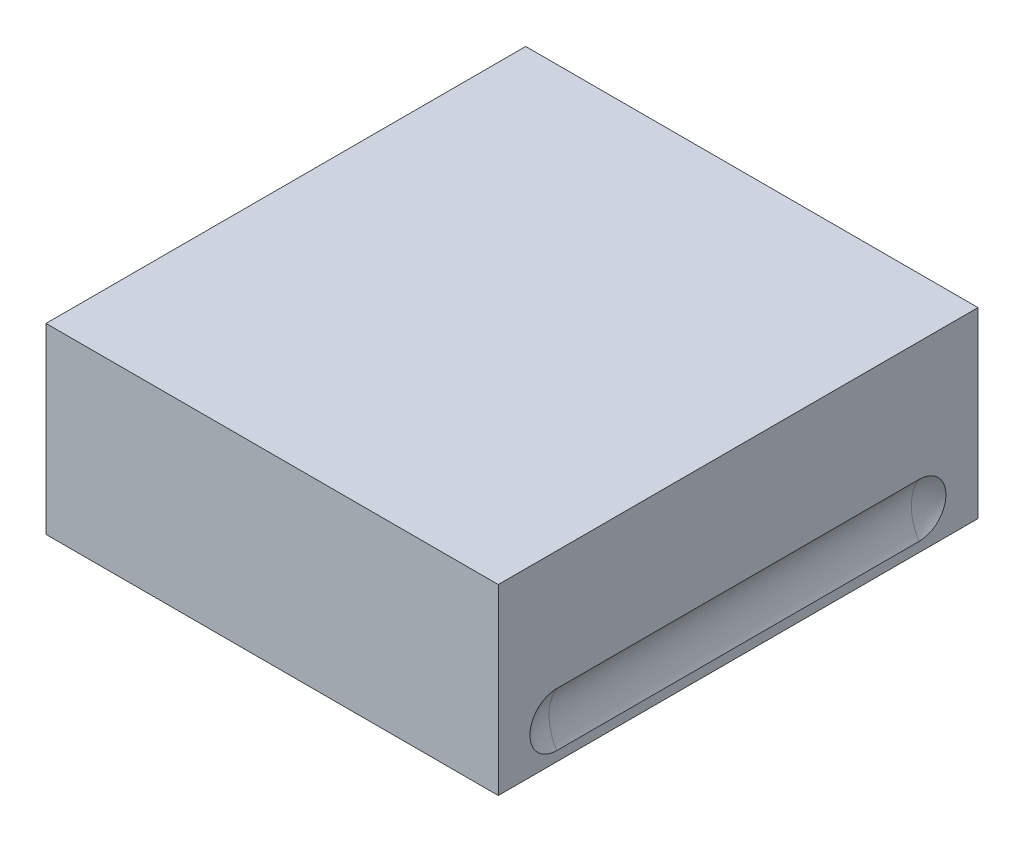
ISO-10303-21;
HEADER;
FILE_DESCRIPTION(('STEP AP214'),'2;1');
FILE_NAME('part.step','',(''),(''),'','','');
FILE_SCHEMA(('AUTOMOTIVE_DESIGN { 1 0 10303 214 1 1 1 1 }'));
ENDSEC;
DATA;
#1=APPLICATION_CONTEXT('core data for automotive mechanical design processes');
#2=APPLICATION_PROTOCOL_DEFINITION('international standard','automotive_design',2000,#1);
#3=PRODUCT_CONTEXT('',#1,'mechanical');
#4=PRODUCT('Part','Part','',(#3));
#5=PRODUCT_RELATED_PRODUCT_CATEGORY('part','',(#4));
#6=PRODUCT_DEFINITION_FORMATION('','',#4);
#7=PRODUCT_DEFINITION_CONTEXT('part definition',#1,'design');
#8=PRODUCT_DEFINITION('design','',#6,#7);
#9=PRODUCT_DEFINITION_SHAPE('','',#8);
#10=(LENGTH_UNIT() NAMED_UNIT(*) SI_UNIT(.MILLI.,.METRE.));
#11=(NAMED_UNIT(*) PLANE_ANGLE_UNIT() SI_UNIT($,.RADIAN.));
#12=(NAMED_UNIT(*) SI_UNIT($,.STERADIAN.) SOLID_ANGLE_UNIT());
#13=UNCERTAINTY_MEASURE_WITH_UNIT(LENGTH_MEASURE(1.E-05),#10,'distance_accuracy_value','');
#14=(GEOMETRIC_REPRESENTATION_CONTEXT(3) GLOBAL_UNCERTAINTY_ASSIGNED_CONTEXT((#13)) GLOBAL_UNIT_ASSIGNED_CONTEXT((#10,
#11,#12)) REPRESENTATION_CONTEXT('',''));
#15=CARTESIAN_POINT('',(0.,0.,0.));
#16=DIRECTION('',(0.,0.,1.));
#17=DIRECTION('',(1.,0.,0.));
#18=AXIS2_PLACEMENT_3D('',#15,#16,#17);
#19=CARTESIAN_POINT('',(0.,67.,-92.5));
#20=DIRECTION('',(0.,1.,0.));
#21=DIRECTION('',(0.,0.,1.));
#22=AXIS2_PLACEMENT_3D('',#19,#20,#21);
#23=PLANE('',#22);
#24=DIRECTION('',(-1.,0.,0.));
#25=VECTOR('',#24,1.);
#26=CARTESIAN_POINT('',(-16.5,67.,-123.));
#27=LINE('',#26,#25);
#28=CARTESIAN_POINT('',(-16.5,67.,-123.));
#29=VERTEX_POINT('',#28);
#30=CARTESIAN_POINT('',(16.5,67.,-123.));
#31=VERTEX_POINT('',#30);
#32=EDGE_CURVE('E272',#29,#31,#27,.F.);
#33=ORIENTED_EDGE('',*,*,#32,.T.);
#34=DIRECTION('',(0.,0.,-1.));
#35=VECTOR('',#34,1.);
#36=CARTESIAN_POINT('',(16.5,67.,-123.));
#37=LINE('',#36,#35);
#38=CARTESIAN_POINT('',(16.5,67.,-62.));
#39=VERTEX_POINT('',#38);
#40=EDGE_CURVE('E271',#31,#39,#37,.F.);
#41=ORIENTED_EDGE('',*,*,#40,.T.);
#42=DIRECTION('',(1.,0.,0.));
#43=VECTOR('',#42,1.);
#44=CARTESIAN_POINT('',(16.5,67.,-62.));
#45=LINE('',#44,#43);
#46=CARTESIAN_POINT('',(-16.5,67.,-62.));
#47=VERTEX_POINT('',#46);
#48=EDGE_CURVE('E279',#39,#47,#45,.F.);
#49=ORIENTED_EDGE('',*,*,#48,.T.);
#50=DIRECTION('',(0.,0.,1.));
#51=VECTOR('',#50,1.);
#52=CARTESIAN_POINT('',(-16.5,67.,-62.));
#53=LINE('',#52,#51);
#54=EDGE_CURVE('E80',#47,#29,#53,.F.);
#55=ORIENTED_EDGE('',*,*,#54,.T.);
#56=EDGE_LOOP('',(#33,#41,#49,#55));
#57=FACE_BOUND('',#56,.T.);
#58=ADVANCED_FACE('F14',(#57),#23,.F.);
#59=CARTESIAN_POINT('',(-16.5,55.,-123.));
#60=DIRECTION('',(0.,0.,-1.));
#61=DIRECTION('',(-1.,0.,0.));
#62=AXIS2_PLACEMENT_3D('',#59,#60,#61);
#63=PLANE('',#62);
#64=DIRECTION('',(0.,1.,0.));
#65=VECTOR('',#64,1.);
#66=CARTESIAN_POINT('',(-16.5,55.,-123.));
#67=LINE('',#66,#65);
#68=CARTESIAN_POINT('',(-16.5,55.,-123.));
#69=VERTEX_POINT('',#68);
#70=EDGE_CURVE('E250',#29,#69,#67,.F.);
#71=ORIENTED_EDGE('',*,*,#70,.T.);
#72=DIRECTION('',(1.,0.,0.));
#73=VECTOR('',#72,1.);
#74=CARTESIAN_POINT('',(0.,55.,-123.));
#75=LINE('',#74,#73);
#76=CARTESIAN_POINT('',(16.5,55.,-123.));
#77=VERTEX_POINT('',#76);
#78=EDGE_CURVE('E218',#69,#77,#75,.T.);
#79=ORIENTED_EDGE('',*,*,#78,.T.);
#80=DIRECTION('',(0.,1.,0.));
#81=VECTOR('',#80,1.);
#82=CARTESIAN_POINT('',(16.5,55.,-123.));
#83=LINE('',#82,#81);
#84=EDGE_CURVE('E263',#77,#31,#83,.T.);
#85=ORIENTED_EDGE('',*,*,#84,.T.);
#86=ORIENTED_EDGE('',*,*,#32,.F.);
#87=EDGE_LOOP('',(#71,#79,#85,#86));
#88=FACE_BOUND('',#87,.T.);
#89=ADVANCED_FACE('F260',(#88),#63,.F.);
#90=CARTESIAN_POINT('',(16.5,55.,-123.));
#91=DIRECTION('',(1.,0.,0.));
#92=DIRECTION('',(0.,0.,-1.));
#93=AXIS2_PLACEMENT_3D('',#90,#91,#92);
#94=PLANE('',#93);
#95=ORIENTED_EDGE('',*,*,#84,.F.);
#96=DIRECTION('',(0.,0.,1.));
#97=VECTOR('',#96,1.);
#98=CARTESIAN_POINT('',(16.5,55.,-92.5));
#99=LINE('',#98,#97);
#100=CARTESIAN_POINT('',(16.5,55.,-62.));
#101=VERTEX_POINT('',#100);
#102=EDGE_CURVE('E221',#77,#101,#99,.T.);
#103=ORIENTED_EDGE('',*,*,#102,.T.);
#104=DIRECTION('',(0.,1.,0.));
#105=VECTOR('',#104,1.);
#106=CARTESIAN_POINT('',(16.5,55.,-62.));
#107=LINE('',#106,#105);
#108=EDGE_CURVE('E274',#101,#39,#107,.T.);
#109=ORIENTED_EDGE('',*,*,#108,.T.);
#110=ORIENTED_EDGE('',*,*,#40,.F.);
#111=EDGE_LOOP('',(#95,#103,#109,#110));
#112=FACE_BOUND('',#111,.T.);
#113=ADVANCED_FACE('F268',(#112),#94,.F.);
#114=CARTESIAN_POINT('',(16.5,55.,-62.));
#115=DIRECTION('',(0.,0.,1.));
#116=DIRECTION('',(1.,0.,0.));
#117=AXIS2_PLACEMENT_3D('',#114,#115,#116);
#118=PLANE('',#117);
#119=ORIENTED_EDGE('',*,*,#108,.F.);
#120=DIRECTION('',(1.,0.,0.));
#121=VECTOR('',#120,1.);
#122=CARTESIAN_POINT('',(0.,55.,-62.));
#123=LINE('',#122,#121);
#124=CARTESIAN_POINT('',(-16.5,55.,-62.));
#125=VERTEX_POINT('',#124);
#126=EDGE_CURVE('E233',#101,#125,#123,.F.);
#127=ORIENTED_EDGE('',*,*,#126,.T.);
#128=DIRECTION('',(0.,1.,0.));
#129=VECTOR('',#128,1.);
#130=CARTESIAN_POINT('',(-16.5,55.,-62.));
#131=LINE('',#130,#129);
#132=EDGE_CURVE('E251',#125,#47,#131,.T.);
#133=ORIENTED_EDGE('',*,*,#132,.T.);
#134=ORIENTED_EDGE('',*,*,#48,.F.);
#135=EDGE_LOOP('',(#119,#127,#133,#134));
#136=FACE_BOUND('',#135,.T.);
#137=ADVANCED_FACE('F288',(#136),#118,.F.);
#138=CARTESIAN_POINT('',(-16.5,55.,-62.));
#139=DIRECTION('',(-1.,0.,0.));
#140=DIRECTION('',(0.,0.,1.));
#141=AXIS2_PLACEMENT_3D('',#138,#139,#140);
#142=PLANE('',#141);
#143=ORIENTED_EDGE('',*,*,#132,.F.);
#144=DIRECTION('',(0.,0.,1.));
#145=VECTOR('',#144,1.);
#146=CARTESIAN_POINT('',(-16.5,55.,-92.5));
#147=LINE('',#146,#145);
#148=EDGE_CURVE('E93',#125,#69,#147,.F.);
#149=ORIENTED_EDGE('',*,*,#148,.T.);
#150=ORIENTED_EDGE('',*,*,#70,.F.);
#151=ORIENTED_EDGE('',*,*,#54,.F.);
#152=EDGE_LOOP('',(#143,#149,#150,#151));
#153=FACE_BOUND('',#152,.T.);
#154=ADVANCED_FACE('F246',(#153),#142,.F.);
#155=CARTESIAN_POINT('',(-58.8,63.,-132.1));
#156=DIRECTION('',(0.125429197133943,0.457110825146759,0.880520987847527));
#157=DIRECTION('',(-0.864631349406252,-0.384852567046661,0.322956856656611));
#158=AXIS2_PLACEMENT_3D('',#155,#156,#157);
#159=SPHERICAL_SURFACE('',#158,11.0000000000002);
#160=CARTESIAN_POINT('',(-58.8,63.,-132.1));
#161=DIRECTION('',(0.,0.,-1.));
#162=DIRECTION('',(-1.,0.,0.));
#163=AXIS2_PLACEMENT_3D('',#160,#161,#162);
#164=CIRCLE('',#163,11.);
#165=CARTESIAN_POINT('',(-49.5,57.12547874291,-132.1));
#166=VERTEX_POINT('',#165);
#167=CARTESIAN_POINT('',(-49.5,68.8745212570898,-132.1));
#168=VERTEX_POINT('',#167);
#169=EDGE_CURVE('E18',#166,#168,#164,.F.);
#170=ORIENTED_EDGE('',*,*,#169,.T.);
#171=CARTESIAN_POINT('',(-49.5,57.1254787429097,-132.1));
#172=CARTESIAN_POINT('',(-49.5,57.1254609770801,-132.265222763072));
#173=CARTESIAN_POINT('',(-49.5,57.1324484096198,-132.430442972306));
#174=CARTESIAN_POINT('',(-49.5,57.1603053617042,-132.759701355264));
#175=CARTESIAN_POINT('',(-49.5,57.1811742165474,-132.923739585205));
#176=CARTESIAN_POINT('',(-49.5,57.2366462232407,-133.249358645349));
#177=CARTESIAN_POINT('',(-49.5,57.2712397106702,-133.410941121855));
#178=CARTESIAN_POINT('',(-49.5,57.3539093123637,-133.730617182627));
#179=CARTESIAN_POINT('',(-49.5,57.401985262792,-133.888710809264));
#180=CARTESIAN_POINT('',(-49.5,57.5112955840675,-134.200332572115));
#181=CARTESIAN_POINT('',(-49.5,57.572533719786,-134.35385938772));
#182=CARTESIAN_POINT('',(-49.5,57.7077496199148,-134.655264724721));
#183=CARTESIAN_POINT('',(-49.5,57.7817320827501,-134.803141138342));
#184=CARTESIAN_POINT('',(-49.5,57.9418494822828,-135.092051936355));
#185=CARTESIAN_POINT('',(-49.5,58.027977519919,-135.23309014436));
#186=CARTESIAN_POINT('',(-49.5,58.2118396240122,-135.507462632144));
#187=CARTESIAN_POINT('',(-49.5,58.3095779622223,-135.640794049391));
#188=CARTESIAN_POINT('',(-49.5,58.5159043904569,-135.89870361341));
#189=CARTESIAN_POINT('',(-49.5,58.6244887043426,-136.02328478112));
#190=CARTESIAN_POINT('',(-49.5,58.8518058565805,-136.262903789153));
#191=CARTESIAN_POINT('',(-49.5,58.9705424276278,-136.377938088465));
#192=CARTESIAN_POINT('',(-49.5,59.2172584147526,-136.597570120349));
#193=CARTESIAN_POINT('',(-49.5,59.3452358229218,-136.70217010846));
#194=CARTESIAN_POINT('',(-49.5,59.6095954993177,-136.900255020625));
#195=CARTESIAN_POINT('',(-49.5,59.7459808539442,-136.993735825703));
#196=CARTESIAN_POINT('',(-49.5,60.0260855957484,-137.168836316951));
#197=CARTESIAN_POINT('',(-49.5,60.1698019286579,-137.250460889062));
#198=CARTESIAN_POINT('',(-49.5,60.4636534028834,-137.401342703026));
#199=CARTESIAN_POINT('',(-49.5,60.6137908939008,-137.470595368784));
#200=CARTESIAN_POINT('',(-49.5,60.9193010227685,-137.596176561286));
#201=CARTESIAN_POINT('',(-49.5,61.0746713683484,-137.65251066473));
#202=CARTESIAN_POINT('',(-49.5,61.3896627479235,-137.751911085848));
#203=CARTESIAN_POINT('',(-49.5,61.549285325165,-137.794972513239));
#204=CARTESIAN_POINT('',(-49.5,61.8715365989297,-137.867480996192));
#205=CARTESIAN_POINT('',(-49.5,62.0341642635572,-137.896932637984));
#206=CARTESIAN_POINT('',(-49.5,62.3613792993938,-137.942041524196));
#207=CARTESIAN_POINT('',(-49.5,62.5259673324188,-137.957693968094));
#208=CARTESIAN_POINT('',(-49.5,62.8558520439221,-137.975074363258));
#209=CARTESIAN_POINT('',(-49.5,63.0211486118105,-137.976804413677));
#210=CARTESIAN_POINT('',(-49.5,63.3512998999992,-137.966333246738));
#211=CARTESIAN_POINT('',(-49.5,63.5161546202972,-137.954132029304));
#212=CARTESIAN_POINT('',(-49.5,63.8442771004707,-137.915881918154));
#213=CARTESIAN_POINT('',(-49.5,64.0075445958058,-137.889830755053));
#214=CARTESIAN_POINT('',(-49.5,64.3312476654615,-137.824076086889));
#215=CARTESIAN_POINT('',(-49.5,64.4916842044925,-137.784377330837));
#216=CARTESIAN_POINT('',(-49.5,64.8086997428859,-137.691591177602));
#217=CARTESIAN_POINT('',(-49.5,64.9652773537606,-137.63849903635));
#218=CARTESIAN_POINT('',(-49.5,65.273345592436,-137.519332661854));
#219=CARTESIAN_POINT('',(-49.5,65.4248380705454,-137.453263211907));
#220=CARTESIAN_POINT('',(-49.5,65.7217786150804,-137.308570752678));
#221=CARTESIAN_POINT('',(-49.5,65.8672242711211,-137.229942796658));
#222=CARTESIAN_POINT('',(-49.5,66.1509207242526,-137.060742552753));
#223=CARTESIAN_POINT('',(-49.5,66.2891741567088,-136.970174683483));
#224=CARTESIAN_POINT('',(-49.5,66.5576043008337,-136.777685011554));
#225=CARTESIAN_POINT('',(-49.5,66.6877784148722,-136.6757595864));
#226=CARTESIAN_POINT('',(-49.5,66.939029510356,-136.461342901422));
#227=CARTESIAN_POINT('',(-49.5,67.0601098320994,-136.348855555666));
#228=CARTESIAN_POINT('',(-49.5,67.2923933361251,-136.11405499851));
#229=CARTESIAN_POINT('',(-49.5,67.4035941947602,-135.991739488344));
#230=CARTESIAN_POINT('',(-49.5,67.6152570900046,-135.738222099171));
#231=CARTESIAN_POINT('',(-49.5,67.7157230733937,-135.607023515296));
#232=CARTESIAN_POINT('',(-49.5,67.9053147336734,-135.33653871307));
#233=CARTESIAN_POINT('',(-49.5,67.9944325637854,-135.197246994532));
#234=CARTESIAN_POINT('',(-49.5,68.1605822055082,-134.91170173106));
#235=CARTESIAN_POINT('',(-49.5,68.237618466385,-134.765450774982));
#236=CARTESIAN_POINT('',(-49.5,68.3791664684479,-134.466832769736));
#237=CARTESIAN_POINT('',(-49.5,68.4436658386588,-134.314459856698));
#238=CARTESIAN_POINT('',(-49.5,68.5595645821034,-134.004875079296));
#239=CARTESIAN_POINT('',(-49.5,68.6109688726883,-133.847665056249));
#240=CARTESIAN_POINT('',(-49.5,68.7002936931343,-133.529651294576));
#241=CARTESIAN_POINT('',(-49.5,68.7382290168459,-133.368851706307));
#242=CARTESIAN_POINT('',(-49.5,68.8004112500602,-133.044693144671));
#243=CARTESIAN_POINT('',(-49.5,68.8246648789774,-132.88133546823));
#244=CARTESIAN_POINT('',(-49.5,68.8528409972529,-132.614685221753));
#245=CARTESIAN_POINT('',(-49.5,68.8609762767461,-132.51181948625));
#246=CARTESIAN_POINT('',(-49.5,68.871812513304,-132.305972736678));
#247=CARTESIAN_POINT('',(-49.5,68.8745224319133,-132.202992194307));
#248=CARTESIAN_POINT('',(-49.5,68.8745212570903,-132.1));
#249=B_SPLINE_CURVE_WITH_KNOTS('',3,(#171,#172,#173,#174,#175,#176,#177,#178,#179,#180,#181,
#182,#183,#184,#185,#186,#187,#188,#189,#190,#191,#192,#193,#194,#195,#196,#197,#198,#199,#200,
#201,#202,#203,#204,#205,#206,#207,#208,#209,#210,#211,#212,#213,#214,#215,#216,#217,#218,#219,
#220,#221,#222,#223,#224,#225,#226,#227,#228,#229,#230,#231,#232,#233,#234,#235,#236,#237,#238,
#239,#240,#241,#242,#243,#244,#245,#246,#247,#248),.UNSPECIFIED.,.F.,.F.,(4,2,2,2,2,2,2,2,2,2,2,
2,2,2,2,2,2,2,2,2,2,2,2,2,2,2,2,2,2,2,2,2,2,2,2,2,2,2,4),(0.,0.495516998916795,
0.991010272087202,1.48615525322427,1.98129421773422,2.47657499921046,2.97203876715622,
3.46722222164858,3.96258843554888,4.45778277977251,4.95315998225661,5.44842986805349,
5.94388265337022,6.4391306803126,6.93456151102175,7.42977806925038,7.92517687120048,
8.42040861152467,8.91581256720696,9.41114182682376,9.90647108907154,10.4018815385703,
10.8971197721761,11.3925336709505,11.8877653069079,12.3831924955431,12.8784368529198,
13.3738396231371,13.8690595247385,14.3643955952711,14.8595489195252,15.3550427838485,
15.8503537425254,16.3461510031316,16.8417618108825,17.3368265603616,17.8316479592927,
18.1410772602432,18.4499950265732),.UNSPECIFIED.);
#250=EDGE_CURVE('E77',#166,#168,#249,.T.);
#251=ORIENTED_EDGE('',*,*,#250,.F.);
#252=EDGE_LOOP('',(#170,#251));
#253=FACE_BOUND('',#252,.T.);
#254=ADVANCED_FACE('F75',(#253),#159,.F.);
#255=CARTESIAN_POINT('',(-58.8,63.,-92.45));
#256=DIRECTION('',(0.,0.,-1.));
#257=DIRECTION('',(-1.,0.,0.));
#258=AXIS2_PLACEMENT_3D('',#255,#256,#257);
#259=CYLINDRICAL_SURFACE('',#258,11.);
#260=ORIENTED_EDGE('',*,*,#169,.F.);
#261=DIRECTION('',(0.,0.,1.));
#262=VECTOR('',#261,1.);
#263=CARTESIAN_POINT('',(-49.5,57.1254787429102,-40.));
#264=LINE('',#263,#262);
#265=CARTESIAN_POINT('',(-49.5,57.1254787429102,-52.8));
#266=VERTEX_POINT('',#265);
#267=EDGE_CURVE('E91',#266,#166,#264,.F.);
#268=ORIENTED_EDGE('',*,*,#267,.F.);
#269=CARTESIAN_POINT('',(-58.8,63.,-52.8));
#270=DIRECTION('',(0.,0.,-1.));
#271=DIRECTION('',(-1.,0.,0.));
#272=AXIS2_PLACEMENT_3D('',#269,#270,#271);
#273=CIRCLE('',#272,11.);
#274=CARTESIAN_POINT('',(-49.5,68.8745212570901,-52.8));
#275=VERTEX_POINT('',#274);
#276=EDGE_CURVE('E79',#266,#275,#273,.F.);
#277=ORIENTED_EDGE('',*,*,#276,.T.);
#278=DIRECTION('',(0.,0.,1.));
#279=VECTOR('',#278,1.);
#280=CARTESIAN_POINT('',(-49.5,68.8745212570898,-40.));
#281=LINE('',#280,#279);
#282=EDGE_CURVE('E82',#168,#275,#281,.T.);
#283=ORIENTED_EDGE('',*,*,#282,.F.);
#284=EDGE_LOOP('',(#260,#268,#277,#283));
#285=FACE_BOUND('',#284,.T.);
#286=ADVANCED_FACE('F83',(#285),#259,.F.);
#287=CARTESIAN_POINT('',(-58.8,63.,-52.8));
#288=DIRECTION('',(0.125429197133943,0.457110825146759,0.880520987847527));
#289=DIRECTION('',(-0.864631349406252,-0.384852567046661,0.322956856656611));
#290=AXIS2_PLACEMENT_3D('',#287,#288,#289);
#291=SPHERICAL_SURFACE('',#290,11.0000000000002);
#292=ORIENTED_EDGE('',*,*,#276,.F.);
#293=CARTESIAN_POINT('',(-49.5,68.8745212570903,-52.8));
#294=CARTESIAN_POINT('',(-49.5,68.87453902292,-52.6347772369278));
#295=CARTESIAN_POINT('',(-49.5,68.8675515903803,-52.469557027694));
#296=CARTESIAN_POINT('',(-49.5,68.8396946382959,-52.1402986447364));
#297=CARTESIAN_POINT('',(-49.5,68.8188257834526,-51.9762604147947));
#298=CARTESIAN_POINT('',(-49.5,68.7633537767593,-51.6506413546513));
#299=CARTESIAN_POINT('',(-49.5,68.7287602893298,-51.4890588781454));
#300=CARTESIAN_POINT('',(-49.5,68.6460906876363,-51.1693828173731));
#301=CARTESIAN_POINT('',(-49.5,68.598014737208,-51.0112891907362));
#302=CARTESIAN_POINT('',(-49.5,68.4887044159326,-50.6996674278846));
#303=CARTESIAN_POINT('',(-49.5,68.4274662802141,-50.5461406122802));
#304=CARTESIAN_POINT('',(-49.5,68.2922503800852,-50.2447352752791));
#305=CARTESIAN_POINT('',(-49.5,68.2182679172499,-50.0968588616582));
#306=CARTESIAN_POINT('',(-49.5,68.0581505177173,-49.8079480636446));
#307=CARTESIAN_POINT('',(-49.5,67.9720224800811,-49.6669098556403));
#308=CARTESIAN_POINT('',(-49.5,67.7881603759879,-49.3925373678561));
#309=CARTESIAN_POINT('',(-49.5,67.6904220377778,-49.2592059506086));
#310=CARTESIAN_POINT('',(-49.5,67.4840956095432,-49.0012963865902));
#311=CARTESIAN_POINT('',(-49.5,67.3755112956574,-48.8767152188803));
#312=CARTESIAN_POINT('',(-49.5,67.1481941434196,-48.6370962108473));
#313=CARTESIAN_POINT('',(-49.5,67.0294575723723,-48.5220619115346));
#314=CARTESIAN_POINT('',(-49.5,66.7827415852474,-48.3024298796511));
#315=CARTESIAN_POINT('',(-49.5,66.6547641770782,-48.1978298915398));
#316=CARTESIAN_POINT('',(-49.5,66.3904045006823,-47.9997449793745));
#317=CARTESIAN_POINT('',(-49.5,66.2540191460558,-47.9062641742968));
#318=CARTESIAN_POINT('',(-49.5,65.9739144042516,-47.7311636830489));
#319=CARTESIAN_POINT('',(-49.5,65.8301980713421,-47.6495391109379));
#320=CARTESIAN_POINT('',(-49.5,65.5363465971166,-47.4986572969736));
#321=CARTESIAN_POINT('',(-49.5,65.3862091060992,-47.4294046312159));
#322=CARTESIAN_POINT('',(-49.5,65.0806989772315,-47.3038234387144));
#323=CARTESIAN_POINT('',(-49.5,64.9253286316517,-47.2474893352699));
#324=CARTESIAN_POINT('',(-49.5,64.6103372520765,-47.148088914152));
#325=CARTESIAN_POINT('',(-49.5,64.4507146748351,-47.105027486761));
#326=CARTESIAN_POINT('',(-49.5,64.1284634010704,-47.0325190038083));
#327=CARTESIAN_POINT('',(-49.5,63.9658357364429,-47.003067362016));
#328=CARTESIAN_POINT('',(-49.5,63.6386207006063,-46.9579584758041));
#329=CARTESIAN_POINT('',(-49.5,63.4740326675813,-46.9423060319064));
#330=CARTESIAN_POINT('',(-49.5,63.1441479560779,-46.924925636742));
#331=CARTESIAN_POINT('',(-49.5,62.9788513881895,-46.9231955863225));
#332=CARTESIAN_POINT('',(-49.5,62.6487001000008,-46.9336667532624));
#333=CARTESIAN_POINT('',(-49.5,62.4838453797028,-46.9458679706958));
#334=CARTESIAN_POINT('',(-49.5,62.1557228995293,-46.9841180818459));
#335=CARTESIAN_POINT('',(-49.5,61.9924554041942,-47.0101692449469));
#336=CARTESIAN_POINT('',(-49.5,61.6687523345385,-47.0759239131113));
#337=CARTESIAN_POINT('',(-49.5,61.5083157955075,-47.1156226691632));
#338=CARTESIAN_POINT('',(-49.5,61.1913002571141,-47.208408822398));
#339=CARTESIAN_POINT('',(-49.5,61.0347226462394,-47.2615009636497));
#340=CARTESIAN_POINT('',(-49.5,60.726654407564,-47.3806673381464));
#341=CARTESIAN_POINT('',(-49.5,60.5751619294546,-47.4467367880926));
#342=CARTESIAN_POINT('',(-49.5,60.2782213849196,-47.5914292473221));
#343=CARTESIAN_POINT('',(-49.5,60.1327757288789,-47.6700572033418));
#344=CARTESIAN_POINT('',(-49.5,59.8490792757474,-47.8392574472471));
#345=CARTESIAN_POINT('',(-49.5,59.7108258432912,-47.9298253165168));
#346=CARTESIAN_POINT('',(-49.5,59.4423956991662,-48.1223149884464));
#347=CARTESIAN_POINT('',(-49.5,59.3122215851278,-48.2242404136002));
#348=CARTESIAN_POINT('',(-49.5,59.060970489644,-48.4386570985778));
#349=CARTESIAN_POINT('',(-49.5,58.9398901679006,-48.5511444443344));
#350=CARTESIAN_POINT('',(-49.5,58.7076066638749,-48.7859450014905));
#351=CARTESIAN_POINT('',(-49.5,58.5964058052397,-48.9082605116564));
#352=CARTESIAN_POINT('',(-49.5,58.3847429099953,-49.161777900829));
#353=CARTESIAN_POINT('',(-49.5,58.2842769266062,-49.2929764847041));
#354=CARTESIAN_POINT('',(-49.5,58.0946852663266,-49.5634612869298));
#355=CARTESIAN_POINT('',(-49.5,58.0055674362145,-49.7027530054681));
#356=CARTESIAN_POINT('',(-49.5,57.8394177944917,-49.9882982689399));
#357=CARTESIAN_POINT('',(-49.5,57.7623815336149,-50.1345492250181));
#358=CARTESIAN_POINT('',(-49.5,57.620833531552,-50.4331672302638));
#359=CARTESIAN_POINT('',(-49.5,57.5563341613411,-50.585540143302));
#360=CARTESIAN_POINT('',(-49.5,57.4404354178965,-50.8951249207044));
#361=CARTESIAN_POINT('',(-49.5,57.3890311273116,-51.0523349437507));
#362=CARTESIAN_POINT('',(-49.5,57.2997063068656,-51.3703487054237));
#363=CARTESIAN_POINT('',(-49.5,57.261770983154,-51.531148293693));
#364=CARTESIAN_POINT('',(-49.5,57.1995887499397,-51.8553068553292));
#365=CARTESIAN_POINT('',(-49.5,57.1753351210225,-52.0186645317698));
#366=CARTESIAN_POINT('',(-49.5,57.147159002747,-52.2853147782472));
#367=CARTESIAN_POINT('',(-49.5,57.1390237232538,-52.3881805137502));
#368=CARTESIAN_POINT('',(-49.5,57.128187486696,-52.5940272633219));
#369=CARTESIAN_POINT('',(-49.5,57.1254775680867,-52.6970078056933));
#370=CARTESIAN_POINT('',(-49.5,57.1254787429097,-52.8));
#371=B_SPLINE_CURVE_WITH_KNOTS('',3,(#293,#294,#295,#296,#297,#298,#299,#300,#301,#302,#303,
#304,#305,#306,#307,#308,#309,#310,#311,#312,#313,#314,#315,#316,#317,#318,#319,#320,#321,#322,
#323,#324,#325,#326,#327,#328,#329,#330,#331,#332,#333,#334,#335,#336,#337,#338,#339,#340,#341,
#342,#343,#344,#345,#346,#347,#348,#349,#350,#351,#352,#353,#354,#355,#356,#357,#358,#359,#360,
#361,#362,#363,#364,#365,#366,#367,#368,#369,#370),.UNSPECIFIED.,.F.,.F.,(4,2,2,2,2,2,2,2,2,2,2,
2,2,2,2,2,2,2,2,2,2,2,2,2,2,2,2,2,2,2,2,2,2,2,2,2,2,2,4),(0.,0.495516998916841,
0.991010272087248,1.48615525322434,1.98129421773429,2.4765749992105,2.97203876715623,
3.46722222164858,3.96258843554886,4.45778277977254,4.95315998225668,5.44842986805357,
5.94388265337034,6.43913068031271,6.93456151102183,7.42977806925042,7.92517687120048,
8.42040861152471,8.91581256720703,9.41114182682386,9.90647108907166,10.4018815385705,
10.8971197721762,11.3925336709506,11.887765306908,12.3831924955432,12.8784368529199,
13.3738396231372,13.8690595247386,14.3643955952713,14.8595489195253,15.3550427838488,
15.8503537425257,16.3461510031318,16.8417618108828,17.3368265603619,17.8316479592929,
18.1410772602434,18.4499950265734),.UNSPECIFIED.);
#372=EDGE_CURVE('E88',#275,#266,#371,.T.);
#373=ORIENTED_EDGE('',*,*,#372,.F.);
#374=EDGE_LOOP('',(#292,#373));
#375=FACE_BOUND('',#374,.T.);
#376=ADVANCED_FACE('F154',(#375),#291,.F.);
#377=CARTESIAN_POINT('',(58.8,63.,-52.8));
#378=DIRECTION('',(0.125429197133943,0.457110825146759,0.880520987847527));
#379=DIRECTION('',(-0.864631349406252,-0.384852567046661,0.322956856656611));
#380=AXIS2_PLACEMENT_3D('',#377,#378,#379);
#381=SPHERICAL_SURFACE('',#380,11.0000000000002);
#382=CARTESIAN_POINT('',(58.8,63.,-52.8));
#383=DIRECTION('',(0.,0.,1.));
#384=DIRECTION('',(1.,0.,0.));
#385=AXIS2_PLACEMENT_3D('',#382,#383,#384);
#386=CIRCLE('',#385,11.);
#387=CARTESIAN_POINT('',(49.5,57.1254787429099,-52.8));
#388=VERTEX_POINT('',#387);
#389=CARTESIAN_POINT('',(49.5,68.8745212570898,-52.8));
#390=VERTEX_POINT('',#389);
#391=EDGE_CURVE('E219',#388,#390,#386,.F.);
#392=ORIENTED_EDGE('',*,*,#391,.T.);
#393=CARTESIAN_POINT('',(49.5,57.1254787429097,-52.8));
#394=CARTESIAN_POINT('',(49.5,57.12546097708,-52.6347772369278));
#395=CARTESIAN_POINT('',(49.5,57.1324484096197,-52.469557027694));
#396=CARTESIAN_POINT('',(49.5,57.1603053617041,-52.1402986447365));
#397=CARTESIAN_POINT('',(49.5,57.1811742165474,-51.9762604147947));
#398=CARTESIAN_POINT('',(49.5,57.2366462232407,-51.6506413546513));
#399=CARTESIAN_POINT('',(49.5,57.2712397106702,-51.4890588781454));
#400=CARTESIAN_POINT('',(49.5,57.3539093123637,-51.1693828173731));
#401=CARTESIAN_POINT('',(49.5,57.4019852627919,-51.0112891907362));
#402=CARTESIAN_POINT('',(49.5,57.5112955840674,-50.6996674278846));
#403=CARTESIAN_POINT('',(49.5,57.5725337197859,-50.5461406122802));
#404=CARTESIAN_POINT('',(49.5,57.7077496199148,-50.2447352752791));
#405=CARTESIAN_POINT('',(49.5,57.7817320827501,-50.0968588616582));
#406=CARTESIAN_POINT('',(49.5,57.9418494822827,-49.8079480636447));
#407=CARTESIAN_POINT('',(49.5,58.0279775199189,-49.6669098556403));
#408=CARTESIAN_POINT('',(49.5,58.2118396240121,-49.3925373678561));
#409=CARTESIAN_POINT('',(49.5,58.3095779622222,-49.2592059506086));
#410=CARTESIAN_POINT('',(49.5,58.5159043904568,-49.0012963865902));
#411=CARTESIAN_POINT('',(49.5,58.6244887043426,-48.8767152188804));
#412=CARTESIAN_POINT('',(49.5,58.8518058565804,-48.6370962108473));
#413=CARTESIAN_POINT('',(49.5,58.9705424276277,-48.5220619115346));
#414=CARTESIAN_POINT('',(49.5,59.2172584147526,-48.3024298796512));
#415=CARTESIAN_POINT('',(49.5,59.3452358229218,-48.1978298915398));
#416=CARTESIAN_POINT('',(49.5,59.6095954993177,-47.9997449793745));
#417=CARTESIAN_POINT('',(49.5,59.7459808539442,-47.9062641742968));
#418=CARTESIAN_POINT('',(49.5,60.0260855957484,-47.7311636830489));
#419=CARTESIAN_POINT('',(49.5,60.1698019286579,-47.6495391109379));
#420=CARTESIAN_POINT('',(49.5,60.4636534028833,-47.4986572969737));
#421=CARTESIAN_POINT('',(49.5,60.6137908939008,-47.4294046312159));
#422=CARTESIAN_POINT('',(49.5,60.9193010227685,-47.3038234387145));
#423=CARTESIAN_POINT('',(49.5,61.0746713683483,-47.24748933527));
#424=CARTESIAN_POINT('',(49.5,61.3896627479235,-47.148088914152));
#425=CARTESIAN_POINT('',(49.5,61.5492853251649,-47.105027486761));
#426=CARTESIAN_POINT('',(49.5,61.8715365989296,-47.0325190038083));
#427=CARTESIAN_POINT('',(49.5,62.0341642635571,-47.003067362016));
#428=CARTESIAN_POINT('',(49.5,62.3613792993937,-46.9579584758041));
#429=CARTESIAN_POINT('',(49.5,62.5259673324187,-46.9423060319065));
#430=CARTESIAN_POINT('',(49.5,62.8558520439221,-46.924925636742));
#431=CARTESIAN_POINT('',(49.5,63.0211486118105,-46.9231955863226));
#432=CARTESIAN_POINT('',(49.5,63.3512998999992,-46.9336667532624));
#433=CARTESIAN_POINT('',(49.5,63.5161546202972,-46.9458679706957));
#434=CARTESIAN_POINT('',(49.5,63.8442771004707,-46.9841180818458));
#435=CARTESIAN_POINT('',(49.5,64.0075445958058,-47.0101692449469));
#436=CARTESIAN_POINT('',(49.5,64.3312476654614,-47.0759239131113));
#437=CARTESIAN_POINT('',(49.5,64.4916842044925,-47.1156226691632));
#438=CARTESIAN_POINT('',(49.5,64.8086997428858,-47.208408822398));
#439=CARTESIAN_POINT('',(49.5,64.9652773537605,-47.2615009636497));
#440=CARTESIAN_POINT('',(49.5,65.2733455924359,-47.3806673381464));
#441=CARTESIAN_POINT('',(49.5,65.4248380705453,-47.4467367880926));
#442=CARTESIAN_POINT('',(49.5,65.7217786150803,-47.5914292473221));
#443=CARTESIAN_POINT('',(49.5,65.867224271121,-47.6700572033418));
#444=CARTESIAN_POINT('',(49.5,66.1509207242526,-47.8392574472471));
#445=CARTESIAN_POINT('',(49.5,66.2891741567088,-47.9298253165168));
#446=CARTESIAN_POINT('',(49.5,66.5576043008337,-48.1223149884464));
#447=CARTESIAN_POINT('',(49.5,66.6877784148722,-48.2242404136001));
#448=CARTESIAN_POINT('',(49.5,66.939029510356,-48.4386570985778));
#449=CARTESIAN_POINT('',(49.5,67.0601098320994,-48.5511444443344));
#450=CARTESIAN_POINT('',(49.5,67.2923933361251,-48.7859450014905));
#451=CARTESIAN_POINT('',(49.5,67.4035941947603,-48.9082605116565));
#452=CARTESIAN_POINT('',(49.5,67.6152570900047,-49.161777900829));
#453=CARTESIAN_POINT('',(49.5,67.7157230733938,-49.2929764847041));
#454=CARTESIAN_POINT('',(49.5,67.9053147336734,-49.5634612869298));
#455=CARTESIAN_POINT('',(49.5,67.9944325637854,-49.7027530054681));
#456=CARTESIAN_POINT('',(49.5,68.1605822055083,-49.9882982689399));
#457=CARTESIAN_POINT('',(49.5,68.2376184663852,-50.1345492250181));
#458=CARTESIAN_POINT('',(49.5,68.379166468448,-50.4331672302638));
#459=CARTESIAN_POINT('',(49.5,68.4436658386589,-50.585540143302));
#460=CARTESIAN_POINT('',(49.5,68.5595645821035,-50.8951249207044));
#461=CARTESIAN_POINT('',(49.5,68.6109688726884,-51.0523349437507));
#462=CARTESIAN_POINT('',(49.5,68.7002936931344,-51.3703487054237));
#463=CARTESIAN_POINT('',(49.5,68.738229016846,-51.531148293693));
#464=CARTESIAN_POINT('',(49.5,68.8004112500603,-51.8553068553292));
#465=CARTESIAN_POINT('',(49.5,68.8246648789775,-52.0186645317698));
#466=CARTESIAN_POINT('',(49.5,68.852840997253,-52.2853147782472));
#467=CARTESIAN_POINT('',(49.5,68.8609762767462,-52.3881805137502));
#468=CARTESIAN_POINT('',(49.5,68.871812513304,-52.5940272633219));
#469=CARTESIAN_POINT('',(49.5,68.8745224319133,-52.6970078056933));
#470=CARTESIAN_POINT('',(49.5,68.8745212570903,-52.8));
#471=B_SPLINE_CURVE_WITH_KNOTS('',3,(#393,#394,#395,#396,#397,#398,#399,#400,#401,#402,#403,
#404,#405,#406,#407,#408,#409,#410,#411,#412,#413,#414,#415,#416,#417,#418,#419,#420,#421,#422,
#423,#424,#425,#426,#427,#428,#429,#430,#431,#432,#433,#434,#435,#436,#437,#438,#439,#440,#441,
#442,#443,#444,#445,#446,#447,#448,#449,#450,#451,#452,#453,#454,#455,#456,#457,#458,#459,#460,
#461,#462,#463,#464,#465,#466,#467,#468,#469,#470),.UNSPECIFIED.,.F.,.F.,(4,2,2,2,2,2,2,2,2,2,2,
2,2,2,2,2,2,2,2,2,2,2,2,2,2,2,2,2,2,2,2,2,2,2,2,2,2,2,4),(0.,0.495516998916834,
0.991010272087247,1.48615525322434,1.98129421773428,2.47657499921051,2.97203876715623,
3.46722222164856,3.96258843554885,4.45778277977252,4.95315998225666,5.44842986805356,
5.94388265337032,6.43913068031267,6.9345615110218,7.42977806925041,7.92517687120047,
8.42040861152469,8.915812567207,9.41114182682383,9.90647108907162,10.4018815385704,
10.8971197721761,11.3925336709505,11.8877653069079,12.3831924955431,12.8784368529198,
13.3738396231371,13.8690595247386,14.3643955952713,14.8595489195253,15.3550427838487,
15.8503537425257,16.3461510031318,16.8417618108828,17.3368265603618,17.8316479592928,
18.1410772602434,18.4499950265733),.UNSPECIFIED.);
#472=EDGE_CURVE('E139',#388,#390,#471,.T.);
#473=ORIENTED_EDGE('',*,*,#472,.F.);
#474=EDGE_LOOP('',(#392,#473));
#475=FACE_BOUND('',#474,.T.);
#476=ADVANCED_FACE('F148',(#475),#381,.F.);
#477=CARTESIAN_POINT('',(58.8,63.,-92.45));
#478=DIRECTION('',(0.,0.,1.));
#479=DIRECTION('',(1.,0.,0.));
#480=AXIS2_PLACEMENT_3D('',#477,#478,#479);
#481=CYLINDRICAL_SURFACE('',#480,11.);
#482=ORIENTED_EDGE('',*,*,#391,.F.);
#483=DIRECTION('',(0.,0.,-1.));
#484=VECTOR('',#483,1.);
#485=CARTESIAN_POINT('',(49.5,57.1254787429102,-145.));
#486=LINE('',#485,#484);
#487=CARTESIAN_POINT('',(49.5,57.1254787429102,-132.1));
#488=VERTEX_POINT('',#487);
#489=EDGE_CURVE('E147',#488,#388,#486,.F.);
#490=ORIENTED_EDGE('',*,*,#489,.F.);
#491=CARTESIAN_POINT('',(58.8,63.,-132.1));
#492=DIRECTION('',(0.,0.,1.));
#493=DIRECTION('',(1.,0.,0.));
#494=AXIS2_PLACEMENT_3D('',#491,#492,#493);
#495=CIRCLE('',#494,11.);
#496=CARTESIAN_POINT('',(49.5,68.8745212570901,-132.1));
#497=VERTEX_POINT('',#496);
#498=EDGE_CURVE('E109',#488,#497,#495,.F.);
#499=ORIENTED_EDGE('',*,*,#498,.T.);
#500=DIRECTION('',(0.,0.,-1.));
#501=VECTOR('',#500,1.);
#502=CARTESIAN_POINT('',(49.5,68.8745212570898,-145.));
#503=LINE('',#502,#501);
#504=EDGE_CURVE('E146',#390,#497,#503,.T.);
#505=ORIENTED_EDGE('',*,*,#504,.F.);
#506=EDGE_LOOP('',(#482,#490,#499,#505));
#507=FACE_BOUND('',#506,.T.);
#508=ADVANCED_FACE('F153',(#507),#481,.F.);
#509=CARTESIAN_POINT('',(58.8,63.,-132.1));
#510=DIRECTION('',(0.125429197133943,0.457110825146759,0.880520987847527));
#511=DIRECTION('',(-0.864631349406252,-0.384852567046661,0.322956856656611));
#512=AXIS2_PLACEMENT_3D('',#509,#510,#511);
#513=SPHERICAL_SURFACE('',#512,11.0000000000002);
#514=ORIENTED_EDGE('',*,*,#498,.F.);
#515=CARTESIAN_POINT('',(49.5,68.8745212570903,-132.1));
#516=CARTESIAN_POINT('',(49.5,68.87453902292,-132.265222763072));
#517=CARTESIAN_POINT('',(49.5,68.8675515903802,-132.430442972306));
#518=CARTESIAN_POINT('',(49.5,68.8396946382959,-132.759701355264));
#519=CARTESIAN_POINT('',(49.5,68.8188257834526,-132.923739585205));
#520=CARTESIAN_POINT('',(49.5,68.7633537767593,-133.249358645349));
#521=CARTESIAN_POINT('',(49.5,68.7287602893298,-133.410941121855));
#522=CARTESIAN_POINT('',(49.5,68.6460906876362,-133.730617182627));
#523=CARTESIAN_POINT('',(49.5,68.598014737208,-133.888710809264));
#524=CARTESIAN_POINT('',(49.5,68.4887044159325,-134.200332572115));
#525=CARTESIAN_POINT('',(49.5,68.427466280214,-134.35385938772));
#526=CARTESIAN_POINT('',(49.5,68.2922503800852,-134.655264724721));
#527=CARTESIAN_POINT('',(49.5,68.2182679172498,-134.803141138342));
#528=CARTESIAN_POINT('',(49.5,68.0581505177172,-135.092051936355));
#529=CARTESIAN_POINT('',(49.5,67.9720224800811,-135.23309014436));
#530=CARTESIAN_POINT('',(49.5,67.7881603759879,-135.507462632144));
#531=CARTESIAN_POINT('',(49.5,67.6904220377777,-135.640794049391));
#532=CARTESIAN_POINT('',(49.5,67.4840956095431,-135.89870361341));
#533=CARTESIAN_POINT('',(49.5,67.3755112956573,-136.02328478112));
#534=CARTESIAN_POINT('',(49.5,67.1481941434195,-136.262903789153));
#535=CARTESIAN_POINT('',(49.5,67.0294575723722,-136.377938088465));
#536=CARTESIAN_POINT('',(49.5,66.7827415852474,-136.597570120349));
#537=CARTESIAN_POINT('',(49.5,66.6547641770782,-136.70217010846));
#538=CARTESIAN_POINT('',(49.5,66.3904045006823,-136.900255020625));
#539=CARTESIAN_POINT('',(49.5,66.2540191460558,-136.993735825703));
#540=CARTESIAN_POINT('',(49.5,65.9739144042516,-137.168836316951));
#541=CARTESIAN_POINT('',(49.5,65.8301980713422,-137.250460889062));
#542=CARTESIAN_POINT('',(49.5,65.5363465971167,-137.401342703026));
#543=CARTESIAN_POINT('',(49.5,65.3862091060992,-137.470595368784));
#544=CARTESIAN_POINT('',(49.5,65.0806989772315,-137.596176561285));
#545=CARTESIAN_POINT('',(49.5,64.9253286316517,-137.65251066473));
#546=CARTESIAN_POINT('',(49.5,64.6103372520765,-137.751911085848));
#547=CARTESIAN_POINT('',(49.5,64.4507146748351,-137.794972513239));
#548=CARTESIAN_POINT('',(49.5,64.1284634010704,-137.867480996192));
#549=CARTESIAN_POINT('',(49.5,63.9658357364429,-137.896932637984));
#550=CARTESIAN_POINT('',(49.5,63.6386207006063,-137.942041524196));
#551=CARTESIAN_POINT('',(49.5,63.4740326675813,-137.957693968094));
#552=CARTESIAN_POINT('',(49.5,63.1441479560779,-137.975074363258));
#553=CARTESIAN_POINT('',(49.5,62.9788513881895,-137.976804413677));
#554=CARTESIAN_POINT('',(49.5,62.6487001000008,-137.966333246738));
#555=CARTESIAN_POINT('',(49.5,62.4838453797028,-137.954132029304));
#556=CARTESIAN_POINT('',(49.5,62.1557228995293,-137.915881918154));
#557=CARTESIAN_POINT('',(49.5,61.9924554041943,-137.889830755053));
#558=CARTESIAN_POINT('',(49.5,61.6687523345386,-137.824076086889));
#559=CARTESIAN_POINT('',(49.5,61.5083157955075,-137.784377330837));
#560=CARTESIAN_POINT('',(49.5,61.1913002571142,-137.691591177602));
#561=CARTESIAN_POINT('',(49.5,61.0347226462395,-137.63849903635));
#562=CARTESIAN_POINT('',(49.5,60.7266544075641,-137.519332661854));
#563=CARTESIAN_POINT('',(49.5,60.5751619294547,-137.453263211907));
#564=CARTESIAN_POINT('',(49.5,60.2782213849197,-137.308570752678));
#565=CARTESIAN_POINT('',(49.5,60.132775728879,-137.229942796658));
#566=CARTESIAN_POINT('',(49.5,59.8490792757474,-137.060742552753));
#567=CARTESIAN_POINT('',(49.5,59.7108258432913,-136.970174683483));
#568=CARTESIAN_POINT('',(49.5,59.4423956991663,-136.777685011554));
#569=CARTESIAN_POINT('',(49.5,59.3122215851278,-136.6757595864));
#570=CARTESIAN_POINT('',(49.5,59.0609704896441,-136.461342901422));
#571=CARTESIAN_POINT('',(49.5,58.9398901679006,-136.348855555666));
#572=CARTESIAN_POINT('',(49.5,58.7076066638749,-136.11405499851));
#573=CARTESIAN_POINT('',(49.5,58.5964058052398,-135.991739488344));
#574=CARTESIAN_POINT('',(49.5,58.3847429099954,-135.738222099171));
#575=CARTESIAN_POINT('',(49.5,58.2842769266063,-135.607023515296));
#576=CARTESIAN_POINT('',(49.5,58.0946852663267,-135.33653871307));
#577=CARTESIAN_POINT('',(49.5,58.0055674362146,-135.197246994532));
#578=CARTESIAN_POINT('',(49.5,57.8394177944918,-134.91170173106));
#579=CARTESIAN_POINT('',(49.5,57.7623815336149,-134.765450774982));
#580=CARTESIAN_POINT('',(49.5,57.6208335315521,-134.466832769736));
#581=CARTESIAN_POINT('',(49.5,57.5563341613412,-134.314459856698));
#582=CARTESIAN_POINT('',(49.5,57.4404354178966,-134.004875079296));
#583=CARTESIAN_POINT('',(49.5,57.3890311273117,-133.847665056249));
#584=CARTESIAN_POINT('',(49.5,57.2997063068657,-133.529651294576));
#585=CARTESIAN_POINT('',(49.5,57.2617709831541,-133.368851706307));
#586=CARTESIAN_POINT('',(49.5,57.1995887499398,-133.044693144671));
#587=CARTESIAN_POINT('',(49.5,57.1753351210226,-132.88133546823));
#588=CARTESIAN_POINT('',(49.5,57.1471590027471,-132.614685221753));
#589=CARTESIAN_POINT('',(49.5,57.1390237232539,-132.51181948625));
#590=CARTESIAN_POINT('',(49.5,57.128187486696,-132.305972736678));
#591=CARTESIAN_POINT('',(49.5,57.1254775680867,-132.202992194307));
#592=CARTESIAN_POINT('',(49.5,57.1254787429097,-132.1));
#593=B_SPLINE_CURVE_WITH_KNOTS('',3,(#515,#516,#517,#518,#519,#520,#521,#522,#523,#524,#525,
#526,#527,#528,#529,#530,#531,#532,#533,#534,#535,#536,#537,#538,#539,#540,#541,#542,#543,#544,
#545,#546,#547,#548,#549,#550,#551,#552,#553,#554,#555,#556,#557,#558,#559,#560,#561,#562,#563,
#564,#565,#566,#567,#568,#569,#570,#571,#572,#573,#574,#575,#576,#577,#578,#579,#580,#581,#582,
#583,#584,#585,#586,#587,#588,#589,#590,#591,#592),.UNSPECIFIED.,.F.,.F.,(4,2,2,2,2,2,2,2,2,2,2,
2,2,2,2,2,2,2,2,2,2,2,2,2,2,2,2,2,2,2,2,2,2,2,2,2,2,2,4),(0.,0.495516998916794,
0.991010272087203,1.48615525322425,1.98129421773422,2.4765749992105,2.97203876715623,
3.46722222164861,3.96258843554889,4.45778277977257,4.95315998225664,5.44842986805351,
5.94388265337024,6.43913068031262,6.93456151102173,7.42977806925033,7.92517687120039,
8.42040861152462,8.91581256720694,9.41114182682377,9.90647108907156,10.4018815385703,
10.897119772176,11.3925336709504,11.8877653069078,12.3831924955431,12.8784368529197,
13.3738396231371,13.8690595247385,14.3643955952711,14.8595489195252,15.3550427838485,
15.8503537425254,16.3461510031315,16.8417618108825,17.3368265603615,17.8316479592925,
18.1410772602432,18.4499950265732),.UNSPECIFIED.);
#594=EDGE_CURVE('E133',#497,#488,#593,.T.);
#595=ORIENTED_EDGE('',*,*,#594,.F.);
#596=EDGE_LOOP('',(#514,#595));
#597=FACE_BOUND('',#596,.T.);
#598=ADVANCED_FACE('F164',(#597),#513,.F.);
#599=CARTESIAN_POINT('',(0.,55.,-92.5));
#600=DIRECTION('',(0.,1.,0.));
#601=DIRECTION('',(0.,0.,1.));
#602=AXIS2_PLACEMENT_3D('',#599,#600,#601);
#603=PLANE('',#602);
#604=DIRECTION('',(0.,0.,1.));
#605=VECTOR('',#604,1.);
#606=CARTESIAN_POINT('',(-49.5,55.,-40.));
#607=LINE('',#606,#605);
#608=CARTESIAN_POINT('',(-49.5,55.,-145.));
#609=VERTEX_POINT('',#608);
#610=CARTESIAN_POINT('',(-49.5,55.,-40.));
#611=VERTEX_POINT('',#610);
#612=EDGE_CURVE('E228',#609,#611,#607,.T.);
#613=ORIENTED_EDGE('',*,*,#612,.F.);
#614=DIRECTION('',(-1.,0.,0.));
#615=VECTOR('',#614,1.);
#616=CARTESIAN_POINT('',(-49.5,55.,-145.));
#617=LINE('',#616,#615);
#618=CARTESIAN_POINT('',(49.5,55.,-145.));
#619=VERTEX_POINT('',#618);
#620=EDGE_CURVE('E196',#619,#609,#617,.T.);
#621=ORIENTED_EDGE('',*,*,#620,.F.);
#622=DIRECTION('',(0.,0.,-1.));
#623=VECTOR('',#622,1.);
#624=CARTESIAN_POINT('',(49.5,55.,-145.));
#625=LINE('',#624,#623);
#626=CARTESIAN_POINT('',(49.5,55.,-40.));
#627=VERTEX_POINT('',#626);
#628=EDGE_CURVE('E203',#627,#619,#625,.T.);
#629=ORIENTED_EDGE('',*,*,#628,.F.);
#630=DIRECTION('',(1.,0.,0.));
#631=VECTOR('',#630,1.);
#632=CARTESIAN_POINT('',(49.5,55.,-40.));
#633=LINE('',#632,#631);
#634=EDGE_CURVE('E224',#611,#627,#633,.T.);
#635=ORIENTED_EDGE('',*,*,#634,.F.);
#636=EDGE_LOOP('',(#613,#621,#629,#635));
#637=FACE_BOUND('',#636,.T.);
#638=ORIENTED_EDGE('',*,*,#126,.F.);
#639=ORIENTED_EDGE('',*,*,#102,.F.);
#640=ORIENTED_EDGE('',*,*,#78,.F.);
#641=ORIENTED_EDGE('',*,*,#148,.F.);
#642=EDGE_LOOP('',(#638,#639,#640,#641));
#643=FACE_BOUND('',#642,.T.);
#644=ADVANCED_FACE('F120',(#637,#643),#603,.F.);
#645=CARTESIAN_POINT('',(-49.5,55.,-40.));
#646=DIRECTION('',(-1.,0.,0.));
#647=DIRECTION('',(0.,0.,1.));
#648=AXIS2_PLACEMENT_3D('',#645,#646,#647);
#649=PLANE('',#648);
#650=ORIENTED_EDGE('',*,*,#612,.T.);
#651=DIRECTION('',(0.,1.,0.));
#652=VECTOR('',#651,1.);
#653=CARTESIAN_POINT('',(-49.5,55.,-40.));
#654=LINE('',#653,#652);
#655=CARTESIAN_POINT('',(-49.5,95.,-40.));
#656=VERTEX_POINT('',#655);
#657=EDGE_CURVE('E210',#656,#611,#654,.F.);
#658=ORIENTED_EDGE('',*,*,#657,.F.);
#659=DIRECTION('',(0.,0.,1.));
#660=VECTOR('',#659,1.);
#661=CARTESIAN_POINT('',(-49.5,95.,-92.5));
#662=LINE('',#661,#660);
#663=CARTESIAN_POINT('',(-49.5,95.,-145.));
#664=VERTEX_POINT('',#663);
#665=EDGE_CURVE('E191',#664,#656,#662,.T.);
#666=ORIENTED_EDGE('',*,*,#665,.F.);
#667=DIRECTION('',(0.,1.,0.));
#668=VECTOR('',#667,1.);
#669=CARTESIAN_POINT('',(-49.5,55.,-145.));
#670=LINE('',#669,#668);
#671=EDGE_CURVE('E194',#609,#664,#670,.T.);
#672=ORIENTED_EDGE('',*,*,#671,.F.);
#673=EDGE_LOOP('',(#650,#658,#666,#672));
#674=FACE_BOUND('',#673,.T.);
#675=ORIENTED_EDGE('',*,*,#282,.T.);
#676=ORIENTED_EDGE('',*,*,#372,.T.);
#677=ORIENTED_EDGE('',*,*,#267,.T.);
#678=ORIENTED_EDGE('',*,*,#250,.T.);
#679=EDGE_LOOP('',(#675,#676,#677,#678));
#680=FACE_BOUND('',#679,.T.);
#681=ADVANCED_FACE('F90',(#674,#680),#649,.T.);
#682=CARTESIAN_POINT('',(49.5,55.,-40.));
#683=DIRECTION('',(0.,0.,1.));
#684=DIRECTION('',(1.,0.,0.));
#685=AXIS2_PLACEMENT_3D('',#682,#683,#684);
#686=PLANE('',#685);
#687=ORIENTED_EDGE('',*,*,#634,.T.);
#688=DIRECTION('',(0.,1.,0.));
#689=VECTOR('',#688,1.);
#690=CARTESIAN_POINT('',(49.5,55.,-40.));
#691=LINE('',#690,#689);
#692=CARTESIAN_POINT('',(49.5,95.,-40.));
#693=VERTEX_POINT('',#692);
#694=EDGE_CURVE('E204',#693,#627,#691,.F.);
#695=ORIENTED_EDGE('',*,*,#694,.F.);
#696=DIRECTION('',(1.,0.,0.));
#697=VECTOR('',#696,1.);
#698=CARTESIAN_POINT('',(0.,95.,-40.));
#699=LINE('',#698,#697);
#700=EDGE_CURVE('E188',#656,#693,#699,.T.);
#701=ORIENTED_EDGE('',*,*,#700,.F.);
#702=ORIENTED_EDGE('',*,*,#657,.T.);
#703=EDGE_LOOP('',(#687,#695,#701,#702));
#704=FACE_BOUND('',#703,.T.);
#705=ADVANCED_FACE('F119',(#704),#686,.T.);
#706=CARTESIAN_POINT('',(49.5,55.,-145.));
#707=DIRECTION('',(1.,0.,0.));
#708=DIRECTION('',(0.,0.,-1.));
#709=AXIS2_PLACEMENT_3D('',#706,#707,#708);
#710=PLANE('',#709);
#711=ORIENTED_EDGE('',*,*,#628,.T.);
#712=DIRECTION('',(0.,1.,0.));
#713=VECTOR('',#712,1.);
#714=CARTESIAN_POINT('',(49.5,55.,-145.));
#715=LINE('',#714,#713);
#716=CARTESIAN_POINT('',(49.5,95.,-145.));
#717=VERTEX_POINT('',#716);
#718=EDGE_CURVE('E33',#717,#619,#715,.F.);
#719=ORIENTED_EDGE('',*,*,#718,.F.);
#720=DIRECTION('',(0.,0.,1.));
#721=VECTOR('',#720,1.);
#722=CARTESIAN_POINT('',(49.5,95.,-92.5));
#723=LINE('',#722,#721);
#724=EDGE_CURVE('E24',#693,#717,#723,.F.);
#725=ORIENTED_EDGE('',*,*,#724,.F.);
#726=ORIENTED_EDGE('',*,*,#694,.T.);
#727=EDGE_LOOP('',(#711,#719,#725,#726));
#728=FACE_BOUND('',#727,.T.);
#729=ORIENTED_EDGE('',*,*,#504,.T.);
#730=ORIENTED_EDGE('',*,*,#594,.T.);
#731=ORIENTED_EDGE('',*,*,#489,.T.);
#732=ORIENTED_EDGE('',*,*,#472,.T.);
#733=EDGE_LOOP('',(#729,#730,#731,#732));
#734=FACE_BOUND('',#733,.T.);
#735=ADVANCED_FACE('F126',(#728,#734),#710,.T.);
#736=CARTESIAN_POINT('',(-49.5,55.,-145.));
#737=DIRECTION('',(0.,0.,-1.));
#738=DIRECTION('',(-1.,0.,0.));
#739=AXIS2_PLACEMENT_3D('',#736,#737,#738);
#740=PLANE('',#739);
#741=ORIENTED_EDGE('',*,*,#620,.T.);
#742=ORIENTED_EDGE('',*,*,#671,.T.);
#743=DIRECTION('',(1.,0.,0.));
#744=VECTOR('',#743,1.);
#745=CARTESIAN_POINT('',(0.,95.,-145.));
#746=LINE('',#745,#744);
#747=EDGE_CURVE('E9',#717,#664,#746,.F.);
#748=ORIENTED_EDGE('',*,*,#747,.F.);
#749=ORIENTED_EDGE('',*,*,#718,.T.);
#750=EDGE_LOOP('',(#741,#742,#748,#749));
#751=FACE_BOUND('',#750,.T.);
#752=ADVANCED_FACE('F130',(#751),#740,.T.);
#753=CARTESIAN_POINT('',(0.,95.,-92.5));
#754=DIRECTION('',(0.,1.,0.));
#755=DIRECTION('',(0.,0.,1.));
#756=AXIS2_PLACEMENT_3D('',#753,#754,#755);
#757=PLANE('',#756);
#758=ORIENTED_EDGE('',*,*,#724,.T.);
#759=ORIENTED_EDGE('',*,*,#747,.T.);
#760=ORIENTED_EDGE('',*,*,#665,.T.);
#761=ORIENTED_EDGE('',*,*,#700,.T.);
#762=EDGE_LOOP('',(#758,#759,#760,#761));
#763=FACE_BOUND('',#762,.T.);
#764=ADVANCED_FACE('F16',(#763),#757,.T.);
#765=CLOSED_SHELL('',(#58,#89,#113,#137,#154,#254,#286,#376,#476,#508,#598,#644,#681,#705,#735,
#752,#764));
#766=MANIFOLD_SOLID_BREP('B1',#765);
#767=ADVANCED_BREP_SHAPE_REPRESENTATION('',(#18,#766),#14);
#768=SHAPE_DEFINITION_REPRESENTATION(#9,#767);
ENDSEC;
END-ISO-10303-21;
